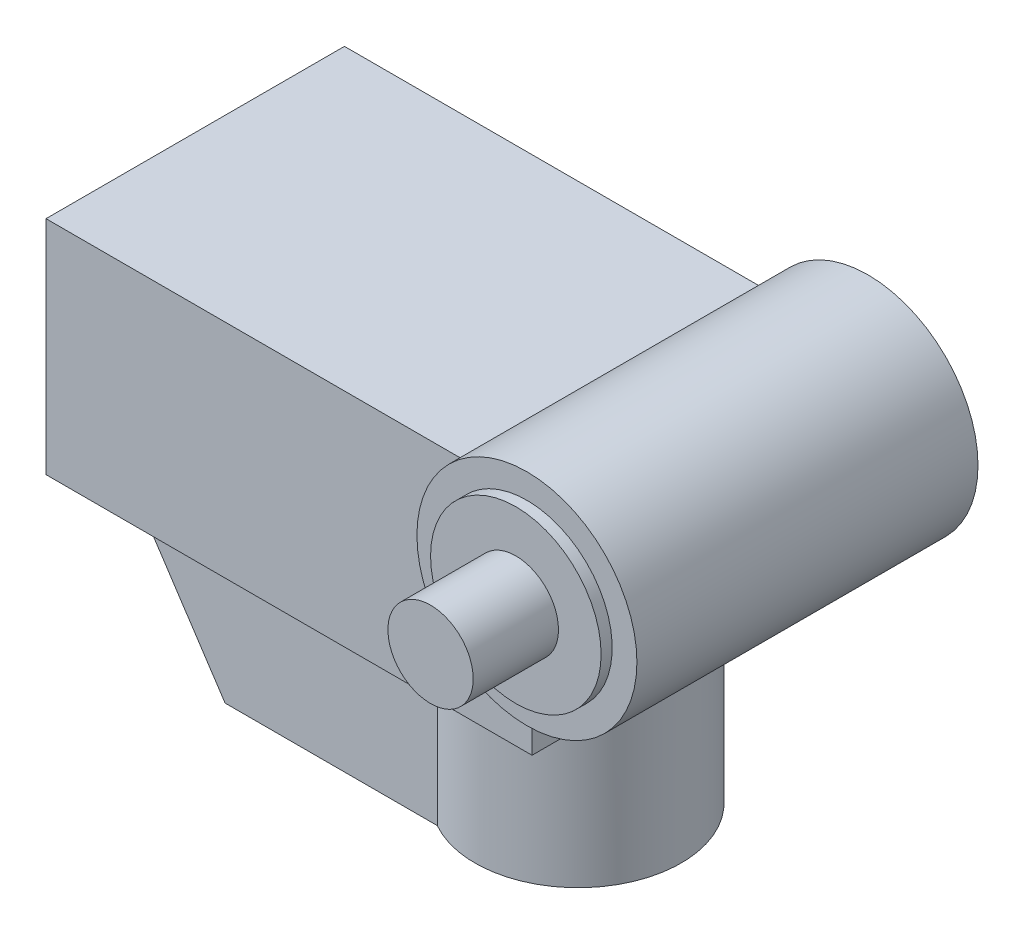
ISO-10303-21;
HEADER;
FILE_DESCRIPTION(('STEP AP214'),'2;1');
FILE_NAME('part.step','',(''),(''),'','','');
FILE_SCHEMA(('AUTOMOTIVE_DESIGN { 1 0 10303 214 1 1 1 1 }'));
ENDSEC;
DATA;
#1=APPLICATION_CONTEXT('core data for automotive mechanical design processes');
#2=APPLICATION_PROTOCOL_DEFINITION('international standard','automotive_design',2000,#1);
#3=PRODUCT_CONTEXT('',#1,'mechanical');
#4=PRODUCT('Part','Part','',(#3));
#5=PRODUCT_RELATED_PRODUCT_CATEGORY('part','',(#4));
#6=PRODUCT_DEFINITION_FORMATION('','',#4);
#7=PRODUCT_DEFINITION_CONTEXT('part definition',#1,'design');
#8=PRODUCT_DEFINITION('design','',#6,#7);
#9=PRODUCT_DEFINITION_SHAPE('','',#8);
#10=(LENGTH_UNIT() NAMED_UNIT(*) SI_UNIT(.MILLI.,.METRE.));
#11=(NAMED_UNIT(*) PLANE_ANGLE_UNIT() SI_UNIT($,.RADIAN.));
#12=(NAMED_UNIT(*) SI_UNIT($,.STERADIAN.) SOLID_ANGLE_UNIT());
#13=UNCERTAINTY_MEASURE_WITH_UNIT(LENGTH_MEASURE(1.E-05),#10,'distance_accuracy_value','');
#14=(GEOMETRIC_REPRESENTATION_CONTEXT(3) GLOBAL_UNCERTAINTY_ASSIGNED_CONTEXT((#13)) GLOBAL_UNIT_ASSIGNED_CONTEXT((#10,
#11,#12)) REPRESENTATION_CONTEXT('',''));
#15=CARTESIAN_POINT('',(0.,0.,0.));
#16=DIRECTION('',(0.,0.,1.));
#17=DIRECTION('',(1.,0.,0.));
#18=AXIS2_PLACEMENT_3D('',#15,#16,#17);
#19=CARTESIAN_POINT('',(70.,189.,106.5));
#20=DIRECTION('',(0.,0.,1.));
#21=DIRECTION('',(1.,0.,0.));
#22=AXIS2_PLACEMENT_3D('',#19,#20,#21);
#23=PLANE('',#22);
#24=CARTESIAN_POINT('',(70.,189.,106.5));
#25=DIRECTION('',(0.,0.,1.));
#26=DIRECTION('',(1.,0.,0.));
#27=AXIS2_PLACEMENT_3D('',#24,#25,#26);
#28=CIRCLE('',#27,50.);
#29=CARTESIAN_POINT('',(120.,189.,106.5));
#30=VERTEX_POINT('',#29);
#31=EDGE_CURVE('E361',#30,#30,#28,.T.);
#32=ORIENTED_EDGE('',*,*,#31,.T.);
#33=EDGE_LOOP('',(#32));
#34=FACE_BOUND('',#33,.T.);
#35=CARTESIAN_POINT('',(70.,189.,106.5));
#36=DIRECTION('',(0.,0.,1.));
#37=DIRECTION('',(1.,0.,0.));
#38=AXIS2_PLACEMENT_3D('',#35,#36,#37);
#39=CIRCLE('',#38,25.);
#40=CARTESIAN_POINT('',(95.,189.,106.5));
#41=VERTEX_POINT('',#40);
#42=EDGE_CURVE('E362',#41,#41,#39,.T.);
#43=ORIENTED_EDGE('',*,*,#42,.F.);
#44=EDGE_LOOP('',(#43));
#45=FACE_BOUND('',#44,.T.);
#46=ADVANCED_FACE('F26',(#34,#45),#23,.T.);
#47=CARTESIAN_POINT('',(70.,189.,100.));
#48=DIRECTION('',(0.,0.,-1.));
#49=DIRECTION('',(-1.,0.,0.));
#50=AXIS2_PLACEMENT_3D('',#47,#48,#49);
#51=PLANE('',#50);
#52=CARTESIAN_POINT('',(70.,189.,100.));
#53=DIRECTION('',(0.,0.,-1.));
#54=DIRECTION('',(-1.,0.,0.));
#55=AXIS2_PLACEMENT_3D('',#52,#53,#54);
#56=CIRCLE('',#55,64.5);
#57=CARTESIAN_POINT('',(5.49999999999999,189.,100.));
#58=VERTEX_POINT('',#57);
#59=EDGE_CURVE('E110',#58,#58,#56,.T.);
#60=ORIENTED_EDGE('',*,*,#59,.F.);
#61=EDGE_LOOP('',(#60));
#62=FACE_BOUND('',#61,.T.);
#63=CARTESIAN_POINT('',(70.,189.,100.));
#64=DIRECTION('',(0.,0.,-1.));
#65=DIRECTION('',(-1.,0.,0.));
#66=AXIS2_PLACEMENT_3D('',#63,#64,#65);
#67=CIRCLE('',#66,50.);
#68=CARTESIAN_POINT('',(20.,189.,100.));
#69=VERTEX_POINT('',#68);
#70=EDGE_CURVE('E11',#69,#69,#67,.F.);
#71=ORIENTED_EDGE('',*,*,#70,.F.);
#72=EDGE_LOOP('',(#71));
#73=FACE_BOUND('',#72,.T.);
#74=ADVANCED_FACE('F226',(#62,#73),#51,.F.);
#75=CARTESIAN_POINT('',(60.5,228.5,-87.5));
#76=DIRECTION('',(0.,0.,1.));
#77=DIRECTION('',(1.,0.,0.));
#78=AXIS2_PLACEMENT_3D('',#75,#76,#77);
#79=PLANE('',#78);
#80=CARTESIAN_POINT('',(70.,189.,-87.5));
#81=DIRECTION('',(0.,0.,-1.));
#82=DIRECTION('',(-1.,0.,0.));
#83=AXIS2_PLACEMENT_3D('',#80,#81,#82);
#84=CIRCLE('',#83,64.5);
#85=CARTESIAN_POINT('',(60.5,125.203448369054,-87.5));
#86=VERTEX_POINT('',#85);
#87=CARTESIAN_POINT('',(19.0098048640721,228.5,-87.5));
#88=VERTEX_POINT('',#87);
#89=EDGE_CURVE('E34',#86,#88,#84,.T.);
#90=ORIENTED_EDGE('',*,*,#89,.F.);
#91=DIRECTION('',(0.,-1.,0.));
#92=VECTOR('',#91,1.);
#93=CARTESIAN_POINT('',(60.5,228.5,-87.5));
#94=LINE('',#93,#92);
#95=CARTESIAN_POINT('',(60.5,98.5,-87.5));
#96=VERTEX_POINT('',#95);
#97=EDGE_CURVE('E151',#86,#96,#94,.T.);
#98=ORIENTED_EDGE('',*,*,#97,.T.);
#99=DIRECTION('',(-1.,0.,0.));
#100=VECTOR('',#99,1.);
#101=CARTESIAN_POINT('',(60.5,98.5,-87.5));
#102=LINE('',#101,#100);
#103=CARTESIAN_POINT('',(-224.5,98.5,-87.5));
#104=VERTEX_POINT('',#103);
#105=EDGE_CURVE('E137',#96,#104,#102,.T.);
#106=ORIENTED_EDGE('',*,*,#105,.T.);
#107=DIRECTION('',(0.,-1.,0.));
#108=VECTOR('',#107,1.);
#109=CARTESIAN_POINT('',(-224.5,228.5,-87.5));
#110=LINE('',#109,#108);
#111=CARTESIAN_POINT('',(-224.5,228.5,-87.5));
#112=VERTEX_POINT('',#111);
#113=EDGE_CURVE('E116',#112,#104,#110,.T.);
#114=ORIENTED_EDGE('',*,*,#113,.F.);
#115=DIRECTION('',(-1.,0.,0.));
#116=VECTOR('',#115,1.);
#117=CARTESIAN_POINT('',(60.5,228.5,-87.5));
#118=LINE('',#117,#116);
#119=EDGE_CURVE('E104',#88,#112,#118,.T.);
#120=ORIENTED_EDGE('',*,*,#119,.F.);
#121=EDGE_LOOP('',(#90,#98,#106,#114,#120));
#122=FACE_BOUND('',#121,.T.);
#123=ADVANCED_FACE('F113',(#122),#79,.F.);
#124=CARTESIAN_POINT('',(-219.5,98.5,52.5));
#125=DIRECTION('',(0.,0.,-1.));
#126=DIRECTION('',(-1.,0.,0.));
#127=AXIS2_PLACEMENT_3D('',#124,#125,#126);
#128=PLANE('',#127);
#129=DIRECTION('',(1.,0.,0.));
#130=VECTOR('',#129,1.);
#131=CARTESIAN_POINT('',(-219.5,98.5,52.5));
#132=LINE('',#131,#130);
#133=CARTESIAN_POINT('',(-219.5,98.5,52.5));
#134=VERTEX_POINT('',#133);
#135=CARTESIAN_POINT('',(-30.0665927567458,98.5,52.5));
#136=VERTEX_POINT('',#135);
#137=EDGE_CURVE('E173',#134,#136,#132,.T.);
#138=ORIENTED_EDGE('',*,*,#137,.F.);
#139=DIRECTION('',(-0.550783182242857,0.834648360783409,0.));
#140=VECTOR('',#139,1.);
#141=CARTESIAN_POINT('',(-219.5,98.5,52.5));
#142=LINE('',#141,#140);
#143=CARTESIAN_POINT('',(-154.5,0.,52.5));
#144=VERTEX_POINT('',#143);
#145=EDGE_CURVE('E153',#144,#134,#142,.T.);
#146=ORIENTED_EDGE('',*,*,#145,.F.);
#147=DIRECTION('',(1.,0.,0.));
#148=VECTOR('',#147,1.);
#149=CARTESIAN_POINT('',(-219.5,0.,52.5));
#150=LINE('',#149,#148);
#151=CARTESIAN_POINT('',(-30.0665927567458,0.,52.5));
#152=VERTEX_POINT('',#151);
#153=EDGE_CURVE('E163',#144,#152,#150,.T.);
#154=ORIENTED_EDGE('',*,*,#153,.T.);
#155=DIRECTION('',(0.,-1.,0.));
#156=VECTOR('',#155,1.);
#157=CARTESIAN_POINT('',(-30.0665927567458,98.5,52.5));
#158=LINE('',#157,#156);
#159=EDGE_CURVE('E126',#136,#152,#158,.T.);
#160=ORIENTED_EDGE('',*,*,#159,.F.);
#161=EDGE_LOOP('',(#138,#146,#154,#160));
#162=FACE_BOUND('',#161,.T.);
#163=ADVANCED_FACE('F28',(#162),#128,.F.);
#164=CARTESIAN_POINT('',(0.,98.5,0.));
#165=DIRECTION('',(0.,-1.,0.));
#166=DIRECTION('',(0.,0.,-1.));
#167=AXIS2_PLACEMENT_3D('',#164,#165,#166);
#168=CYLINDRICAL_SURFACE('',#167,60.5);
#169=CARTESIAN_POINT('',(0.,0.,0.));
#170=DIRECTION('',(0.,1.,0.));
#171=DIRECTION('',(0.,0.,1.));
#172=AXIS2_PLACEMENT_3D('',#169,#170,#171);
#173=CIRCLE('',#172,60.5);
#174=CARTESIAN_POINT('',(-30.0665927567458,0.,-52.5));
#175=VERTEX_POINT('',#174);
#176=EDGE_CURVE('E165',#152,#175,#173,.T.);
#177=ORIENTED_EDGE('',*,*,#176,.T.);
#178=DIRECTION('',(0.,-1.,0.));
#179=VECTOR('',#178,1.);
#180=CARTESIAN_POINT('',(-30.0665927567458,98.5,-52.5));
#181=LINE('',#180,#179);
#182=CARTESIAN_POINT('',(-30.0665927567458,98.5,-52.5));
#183=VERTEX_POINT('',#182);
#184=EDGE_CURVE('E181',#183,#175,#181,.T.);
#185=ORIENTED_EDGE('',*,*,#184,.F.);
#186=CARTESIAN_POINT('',(0.,98.5,0.));
#187=DIRECTION('',(0.,1.,0.));
#188=DIRECTION('',(0.,0.,1.));
#189=AXIS2_PLACEMENT_3D('',#186,#187,#188);
#190=CIRCLE('',#189,60.5);
#191=CARTESIAN_POINT('',(60.5,98.5,0.));
#192=VERTEX_POINT('',#191);
#193=EDGE_CURVE('E49',#192,#183,#190,.T.);
#194=ORIENTED_EDGE('',*,*,#193,.F.);
#195=EDGE_CURVE('E176',#136,#192,#190,.T.);
#196=ORIENTED_EDGE('',*,*,#195,.F.);
#197=ORIENTED_EDGE('',*,*,#159,.T.);
#198=EDGE_LOOP('',(#177,#185,#194,#196,#197));
#199=FACE_BOUND('',#198,.T.);
#200=ADVANCED_FACE('F186',(#199),#168,.T.);
#201=CARTESIAN_POINT('',(-219.5,98.5,-52.5));
#202=DIRECTION('',(0.,0.,1.));
#203=DIRECTION('',(1.,0.,0.));
#204=AXIS2_PLACEMENT_3D('',#201,#202,#203);
#205=PLANE('',#204);
#206=DIRECTION('',(-1.,0.,0.));
#207=VECTOR('',#206,1.);
#208=CARTESIAN_POINT('',(-219.5,0.,-52.5));
#209=LINE('',#208,#207);
#210=CARTESIAN_POINT('',(-154.5,0.,-52.5));
#211=VERTEX_POINT('',#210);
#212=EDGE_CURVE('E167',#175,#211,#209,.T.);
#213=ORIENTED_EDGE('',*,*,#212,.T.);
#214=DIRECTION('',(-0.550783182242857,0.834648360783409,0.));
#215=VECTOR('',#214,1.);
#216=CARTESIAN_POINT('',(-219.5,98.5,-52.5));
#217=LINE('',#216,#215);
#218=CARTESIAN_POINT('',(-219.5,98.5,-52.5));
#219=VERTEX_POINT('',#218);
#220=EDGE_CURVE('E155',#211,#219,#217,.T.);
#221=ORIENTED_EDGE('',*,*,#220,.T.);
#222=DIRECTION('',(-1.,0.,0.));
#223=VECTOR('',#222,1.);
#224=CARTESIAN_POINT('',(-219.5,98.5,-52.5));
#225=LINE('',#224,#223);
#226=EDGE_CURVE('E178',#183,#219,#225,.T.);
#227=ORIENTED_EDGE('',*,*,#226,.F.);
#228=ORIENTED_EDGE('',*,*,#184,.T.);
#229=EDGE_LOOP('',(#213,#221,#227,#228));
#230=FACE_BOUND('',#229,.T.);
#231=ADVANCED_FACE('F194',(#230),#205,.F.);
#232=CARTESIAN_POINT('',(0.,0.,0.));
#233=DIRECTION('',(0.,1.,0.));
#234=DIRECTION('',(0.,0.,1.));
#235=AXIS2_PLACEMENT_3D('',#232,#233,#234);
#236=PLANE('',#235);
#237=CARTESIAN_POINT('',(0.,0.,0.));
#238=DIRECTION('',(0.,-1.,0.));
#239=DIRECTION('',(0.,0.,-1.));
#240=AXIS2_PLACEMENT_3D('',#237,#238,#239);
#241=CIRCLE('',#240,25.);
#242=CARTESIAN_POINT('',(0.,0.,-25.));
#243=VERTEX_POINT('',#242);
#244=EDGE_CURVE('E157',#243,#243,#241,.T.);
#245=ORIENTED_EDGE('',*,*,#244,.F.);
#246=EDGE_LOOP('',(#245));
#247=FACE_BOUND('',#246,.T.);
#248=ORIENTED_EDGE('',*,*,#153,.F.);
#249=DIRECTION('',(0.,0.,-1.));
#250=VECTOR('',#249,1.);
#251=CARTESIAN_POINT('',(-154.5,0.,0.));
#252=LINE('',#251,#250);
#253=EDGE_CURVE('E123',#144,#211,#252,.T.);
#254=ORIENTED_EDGE('',*,*,#253,.T.);
#255=ORIENTED_EDGE('',*,*,#212,.F.);
#256=ORIENTED_EDGE('',*,*,#176,.F.);
#257=EDGE_LOOP('',(#248,#254,#255,#256));
#258=FACE_BOUND('',#257,.T.);
#259=ADVANCED_FACE('F192',(#247,#258),#236,.F.);
#260=CARTESIAN_POINT('',(0.,50.,0.));
#261=DIRECTION('',(0.,-1.,0.));
#262=DIRECTION('',(0.,0.,-1.));
#263=AXIS2_PLACEMENT_3D('',#260,#261,#262);
#264=CYLINDRICAL_SURFACE('',#263,25.);
#265=CARTESIAN_POINT('',(0.,50.,0.));
#266=DIRECTION('',(0.,-1.,0.));
#267=DIRECTION('',(0.,0.,-1.));
#268=AXIS2_PLACEMENT_3D('',#265,#266,#267);
#269=CIRCLE('',#268,25.);
#270=CARTESIAN_POINT('',(0.,50.,-25.));
#271=VERTEX_POINT('',#270);
#272=EDGE_CURVE('E160',#271,#271,#269,.T.);
#273=ORIENTED_EDGE('',*,*,#272,.F.);
#274=EDGE_LOOP('',(#273));
#275=FACE_BOUND('',#274,.T.);
#276=ORIENTED_EDGE('',*,*,#244,.T.);
#277=EDGE_LOOP('',(#276));
#278=FACE_BOUND('',#277,.T.);
#279=ADVANCED_FACE('F222',(#275,#278),#264,.F.);
#280=CARTESIAN_POINT('',(0.,50.,0.));
#281=DIRECTION('',(0.,-1.,0.));
#282=DIRECTION('',(0.,0.,-1.));
#283=AXIS2_PLACEMENT_3D('',#280,#281,#282);
#284=PLANE('',#283);
#285=ORIENTED_EDGE('',*,*,#272,.T.);
#286=EDGE_LOOP('',(#285));
#287=FACE_BOUND('',#286,.T.);
#288=ADVANCED_FACE('F212',(#287),#284,.T.);
#289=CARTESIAN_POINT('',(-219.5,98.5,-60.5));
#290=DIRECTION('',(0.834648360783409,0.550783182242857,0.));
#291=DIRECTION('',(-0.550783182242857,0.834648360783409,0.));
#292=AXIS2_PLACEMENT_3D('',#289,#290,#291);
#293=PLANE('',#292);
#294=ORIENTED_EDGE('',*,*,#253,.F.);
#295=ORIENTED_EDGE('',*,*,#145,.T.);
#296=DIRECTION('',(0.,0.,1.));
#297=VECTOR('',#296,1.);
#298=CARTESIAN_POINT('',(-219.5,98.5,-52.5));
#299=LINE('',#298,#297);
#300=EDGE_CURVE('E170',#219,#134,#299,.T.);
#301=ORIENTED_EDGE('',*,*,#300,.F.);
#302=ORIENTED_EDGE('',*,*,#220,.F.);
#303=EDGE_LOOP('',(#294,#295,#301,#302));
#304=FACE_BOUND('',#303,.T.);
#305=ADVANCED_FACE('F210',(#304),#293,.F.);
#306=CARTESIAN_POINT('',(60.5,228.5,-87.5));
#307=DIRECTION('',(-1.,0.,0.));
#308=DIRECTION('',(0.,0.,1.));
#309=AXIS2_PLACEMENT_3D('',#306,#307,#308);
#310=PLANE('',#309);
#311=ORIENTED_EDGE('',*,*,#97,.F.);
#312=DIRECTION('',(0.,0.,-1.));
#313=VECTOR('',#312,1.);
#314=CARTESIAN_POINT('',(60.5,125.203448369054,100.));
#315=LINE('',#314,#313);
#316=CARTESIAN_POINT('',(60.5,125.203448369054,87.5));
#317=VERTEX_POINT('',#316);
#318=EDGE_CURVE('E41',#86,#317,#315,.F.);
#319=ORIENTED_EDGE('',*,*,#318,.T.);
#320=DIRECTION('',(0.,-1.,0.));
#321=VECTOR('',#320,1.);
#322=CARTESIAN_POINT('',(60.5,228.5,87.5));
#323=LINE('',#322,#321);
#324=CARTESIAN_POINT('',(60.5,98.5,87.5));
#325=VERTEX_POINT('',#324);
#326=EDGE_CURVE('E145',#317,#325,#323,.T.);
#327=ORIENTED_EDGE('',*,*,#326,.T.);
#328=DIRECTION('',(0.,0.,-1.));
#329=VECTOR('',#328,1.);
#330=CARTESIAN_POINT('',(60.5,98.5,-87.5));
#331=LINE('',#330,#329);
#332=EDGE_CURVE('E134',#325,#192,#331,.T.);
#333=ORIENTED_EDGE('',*,*,#332,.T.);
#334=EDGE_CURVE('E133',#192,#96,#331,.T.);
#335=ORIENTED_EDGE('',*,*,#334,.T.);
#336=EDGE_LOOP('',(#311,#319,#327,#333,#335));
#337=FACE_BOUND('',#336,.T.);
#338=ADVANCED_FACE('F205',(#337),#310,.F.);
#339=CARTESIAN_POINT('',(-224.5,228.5,-87.5));
#340=DIRECTION('',(1.,0.,0.));
#341=DIRECTION('',(0.,0.,-1.));
#342=AXIS2_PLACEMENT_3D('',#339,#340,#341);
#343=PLANE('',#342);
#344=DIRECTION('',(0.,0.,1.));
#345=VECTOR('',#344,1.);
#346=CARTESIAN_POINT('',(-224.5,98.5,-87.5));
#347=LINE('',#346,#345);
#348=CARTESIAN_POINT('',(-224.5,98.5,87.5));
#349=VERTEX_POINT('',#348);
#350=EDGE_CURVE('E139',#104,#349,#347,.T.);
#351=ORIENTED_EDGE('',*,*,#350,.T.);
#352=DIRECTION('',(0.,-1.,0.));
#353=VECTOR('',#352,1.);
#354=CARTESIAN_POINT('',(-224.5,228.5,87.5));
#355=LINE('',#354,#353);
#356=CARTESIAN_POINT('',(-224.5,228.5,87.5));
#357=VERTEX_POINT('',#356);
#358=EDGE_CURVE('E147',#357,#349,#355,.T.);
#359=ORIENTED_EDGE('',*,*,#358,.F.);
#360=DIRECTION('',(0.,0.,1.));
#361=VECTOR('',#360,1.);
#362=CARTESIAN_POINT('',(-224.5,228.5,-87.5));
#363=LINE('',#362,#361);
#364=EDGE_CURVE('E118',#112,#357,#363,.T.);
#365=ORIENTED_EDGE('',*,*,#364,.F.);
#366=ORIENTED_EDGE('',*,*,#113,.T.);
#367=EDGE_LOOP('',(#351,#359,#365,#366));
#368=FACE_BOUND('',#367,.T.);
#369=ADVANCED_FACE('F219',(#368),#343,.F.);
#370=CARTESIAN_POINT('',(60.5,228.5,87.5));
#371=DIRECTION('',(0.,0.,-1.));
#372=DIRECTION('',(-1.,0.,0.));
#373=AXIS2_PLACEMENT_3D('',#370,#371,#372);
#374=PLANE('',#373);
#375=ORIENTED_EDGE('',*,*,#326,.F.);
#376=CARTESIAN_POINT('',(70.,189.,87.5));
#377=DIRECTION('',(0.,0.,-1.));
#378=DIRECTION('',(-1.,0.,0.));
#379=AXIS2_PLACEMENT_3D('',#376,#377,#378);
#380=CIRCLE('',#379,64.5);
#381=CARTESIAN_POINT('',(19.0098048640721,228.5,87.5));
#382=VERTEX_POINT('',#381);
#383=EDGE_CURVE('E109',#317,#382,#380,.T.);
#384=ORIENTED_EDGE('',*,*,#383,.T.);
#385=DIRECTION('',(1.,0.,0.));
#386=VECTOR('',#385,1.);
#387=CARTESIAN_POINT('',(60.5,228.5,87.5));
#388=LINE('',#387,#386);
#389=EDGE_CURVE('E107',#357,#382,#388,.T.);
#390=ORIENTED_EDGE('',*,*,#389,.F.);
#391=ORIENTED_EDGE('',*,*,#358,.T.);
#392=DIRECTION('',(1.,0.,0.));
#393=VECTOR('',#392,1.);
#394=CARTESIAN_POINT('',(60.5,98.5,87.5));
#395=LINE('',#394,#393);
#396=EDGE_CURVE('E119',#349,#325,#395,.T.);
#397=ORIENTED_EDGE('',*,*,#396,.T.);
#398=EDGE_LOOP('',(#375,#384,#390,#391,#397));
#399=FACE_BOUND('',#398,.T.);
#400=ADVANCED_FACE('F256',(#399),#374,.F.);
#401=CARTESIAN_POINT('',(60.5,228.5,87.5));
#402=DIRECTION('',(0.,-1.,0.));
#403=DIRECTION('',(0.,0.,-1.));
#404=AXIS2_PLACEMENT_3D('',#401,#402,#403);
#405=PLANE('',#404);
#406=ORIENTED_EDGE('',*,*,#389,.T.);
#407=DIRECTION('',(0.,0.,-1.));
#408=VECTOR('',#407,1.);
#409=CARTESIAN_POINT('',(19.0098048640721,228.5,100.));
#410=LINE('',#409,#408);
#411=EDGE_CURVE('E101',#382,#88,#410,.T.);
#412=ORIENTED_EDGE('',*,*,#411,.T.);
#413=ORIENTED_EDGE('',*,*,#119,.T.);
#414=ORIENTED_EDGE('',*,*,#364,.T.);
#415=EDGE_LOOP('',(#406,#412,#413,#414));
#416=FACE_BOUND('',#415,.T.);
#417=ADVANCED_FACE('F103',(#416),#405,.F.);
#418=CARTESIAN_POINT('',(60.5,98.5,87.5));
#419=DIRECTION('',(0.,-1.,0.));
#420=DIRECTION('',(0.,0.,-1.));
#421=AXIS2_PLACEMENT_3D('',#418,#419,#420);
#422=PLANE('',#421);
#423=ORIENTED_EDGE('',*,*,#226,.T.);
#424=ORIENTED_EDGE('',*,*,#300,.T.);
#425=ORIENTED_EDGE('',*,*,#137,.T.);
#426=ORIENTED_EDGE('',*,*,#195,.T.);
#427=ORIENTED_EDGE('',*,*,#332,.F.);
#428=ORIENTED_EDGE('',*,*,#396,.F.);
#429=ORIENTED_EDGE('',*,*,#350,.F.);
#430=ORIENTED_EDGE('',*,*,#105,.F.);
#431=ORIENTED_EDGE('',*,*,#334,.F.);
#432=ORIENTED_EDGE('',*,*,#193,.T.);
#433=EDGE_LOOP('',(#423,#424,#425,#426,#427,#428,#429,#430,#431,#432));
#434=FACE_BOUND('',#433,.T.);
#435=ADVANCED_FACE('F199',(#434),#422,.T.);
#436=CARTESIAN_POINT('',(70.,189.,-100.));
#437=DIRECTION('',(0.,0.,1.));
#438=DIRECTION('',(1.,0.,0.));
#439=AXIS2_PLACEMENT_3D('',#436,#437,#438);
#440=CYLINDRICAL_SURFACE('',#439,64.5);
#441=CARTESIAN_POINT('',(70.,189.,-100.));
#442=DIRECTION('',(0.,0.,-1.));
#443=DIRECTION('',(-1.,0.,0.));
#444=AXIS2_PLACEMENT_3D('',#441,#442,#443);
#445=CIRCLE('',#444,64.5);
#446=CARTESIAN_POINT('',(5.49999999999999,189.,-100.));
#447=VERTEX_POINT('',#446);
#448=EDGE_CURVE('E130',#447,#447,#445,.T.);
#449=ORIENTED_EDGE('',*,*,#448,.F.);
#450=EDGE_LOOP('',(#449));
#451=FACE_BOUND('',#450,.T.);
#452=ORIENTED_EDGE('',*,*,#89,.T.);
#453=ORIENTED_EDGE('',*,*,#411,.F.);
#454=ORIENTED_EDGE('',*,*,#383,.F.);
#455=ORIENTED_EDGE('',*,*,#318,.F.);
#456=EDGE_LOOP('',(#452,#453,#454,#455));
#457=FACE_BOUND('',#456,.T.);
#458=ORIENTED_EDGE('',*,*,#59,.T.);
#459=EDGE_LOOP('',(#458));
#460=FACE_BOUND('',#459,.T.);
#461=ADVANCED_FACE('F121',(#451,#457,#460),#440,.T.);
#462=CARTESIAN_POINT('',(70.,189.,-100.));
#463=DIRECTION('',(0.,0.,-1.));
#464=DIRECTION('',(-1.,0.,0.));
#465=AXIS2_PLACEMENT_3D('',#462,#463,#464);
#466=PLANE('',#465);
#467=ORIENTED_EDGE('',*,*,#448,.T.);
#468=EDGE_LOOP('',(#467));
#469=FACE_BOUND('',#468,.T.);
#470=ADVANCED_FACE('F243',(#469),#466,.T.);
#471=CARTESIAN_POINT('',(70.,189.,106.5));
#472=DIRECTION('',(0.,0.,-1.));
#473=DIRECTION('',(-1.,0.,0.));
#474=AXIS2_PLACEMENT_3D('',#471,#472,#473);
#475=CYLINDRICAL_SURFACE('',#474,50.);
#476=ORIENTED_EDGE('',*,*,#31,.F.);
#477=EDGE_LOOP('',(#476));
#478=FACE_BOUND('',#477,.T.);
#479=ORIENTED_EDGE('',*,*,#70,.T.);
#480=EDGE_LOOP('',(#479));
#481=FACE_BOUND('',#480,.T.);
#482=ADVANCED_FACE('F242',(#478,#481),#475,.T.);
#483=CARTESIAN_POINT('',(70.,189.,156.5));
#484=DIRECTION('',(0.,0.,-1.));
#485=DIRECTION('',(-1.,0.,0.));
#486=AXIS2_PLACEMENT_3D('',#483,#484,#485);
#487=CYLINDRICAL_SURFACE('',#486,25.);
#488=CARTESIAN_POINT('',(70.,189.,156.5));
#489=DIRECTION('',(0.,0.,1.));
#490=DIRECTION('',(1.,0.,0.));
#491=AXIS2_PLACEMENT_3D('',#488,#489,#490);
#492=CIRCLE('',#491,25.);
#493=CARTESIAN_POINT('',(95.,189.,156.5));
#494=VERTEX_POINT('',#493);
#495=EDGE_CURVE('E360',#494,#494,#492,.T.);
#496=ORIENTED_EDGE('',*,*,#495,.F.);
#497=EDGE_LOOP('',(#496));
#498=FACE_BOUND('',#497,.T.);
#499=ORIENTED_EDGE('',*,*,#42,.T.);
#500=EDGE_LOOP('',(#499));
#501=FACE_BOUND('',#500,.T.);
#502=ADVANCED_FACE('F240',(#498,#501),#487,.T.);
#503=CARTESIAN_POINT('',(70.,189.,156.5));
#504=DIRECTION('',(0.,0.,1.));
#505=DIRECTION('',(1.,0.,0.));
#506=AXIS2_PLACEMENT_3D('',#503,#504,#505);
#507=PLANE('',#506);
#508=ORIENTED_EDGE('',*,*,#495,.T.);
#509=EDGE_LOOP('',(#508));
#510=FACE_BOUND('',#509,.T.);
#511=ADVANCED_FACE('F350',(#510),#507,.T.);
#512=CLOSED_SHELL('',(#46,#74,#123,#163,#200,#231,#259,#279,#288,#305,#338,#369,#400,#417,#435,
#461,#470,#482,#502,#511));
#513=MANIFOLD_SOLID_BREP('B2',#512);
#514=ADVANCED_BREP_SHAPE_REPRESENTATION('',(#18,#513),#14);
#515=SHAPE_DEFINITION_REPRESENTATION(#9,#514);
ENDSEC;
END-ISO-10303-21;
